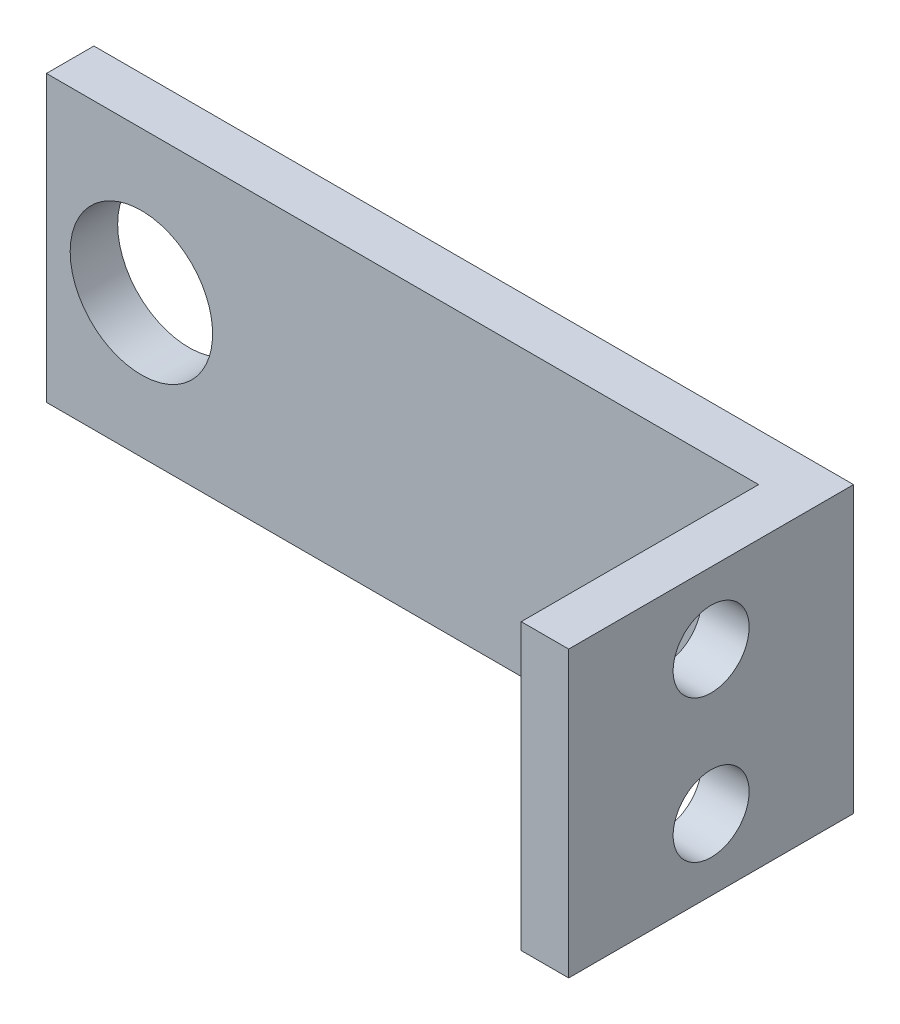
from build123d import *

# Parameters (mm, degrees)
ESQUISSE1_W             = 80
ESQUISSE1_H             = 30
BASE_EXTRUSION_DEPTH    = 5
ESQUISSE2_W             = 5
ESQUISSE2_H             = 30
BOSS_EXTRU_1_DEPTH      = 25
ESQUISSE3_R             = 7.5
ENL_V_MAT_EXTRU_1_DEPTH = 91.553851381
ESQUISSE4_R             = 4
ENL_V_MAT_EXTRU_2_DEPTH = 91.553851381


with BuildPart() as part:
    # Esquisse1 → Base-Extrusion (new body)
    with BuildSketch(Plane.XY):
        with Locations((40, 15)):
            Rectangle(ESQUISSE1_W, ESQUISSE1_H)
    extrude(amount=BASE_EXTRUSION_DEPTH)

    # Esquisse2 → Boss.-Extru.1 (add)
    with BuildSketch(Plane.XY.offset(5)):
        with Locations((77.5, 15)):
            Rectangle(ESQUISSE2_W, ESQUISSE2_H)
    extrude(amount=BOSS_EXTRU_1_DEPTH)

    # Esquisse3 → Enl_v. mat.-Extru.1 (cut, through all)
    with BuildSketch(Plane(origin=(0, 0, 0), x_dir=(-1, 0, 0), z_dir=(0, 0, -1))):
        with Locations((-10, 15)):
            Circle(ESQUISSE3_R)
    extrude(amount=-ENL_V_MAT_EXTRU_1_DEPTH, mode=Mode.SUBTRACT)

    # Esquisse4 → Enl_v. mat.-Extru.2 (cut, through all)
    with BuildSketch(Plane(origin=(80, 0, 0), x_dir=(0, 0, -1), z_dir=(1, 0, 0))):
        with Locations((-15, 22.5)):
            Circle(ESQUISSE4_R)
        with Locations((-15, 7.5)):
            Circle(ESQUISSE4_R)
    extrude(amount=-ENL_V_MAT_EXTRU_2_DEPTH, mode=Mode.SUBTRACT)


solid = part.part
